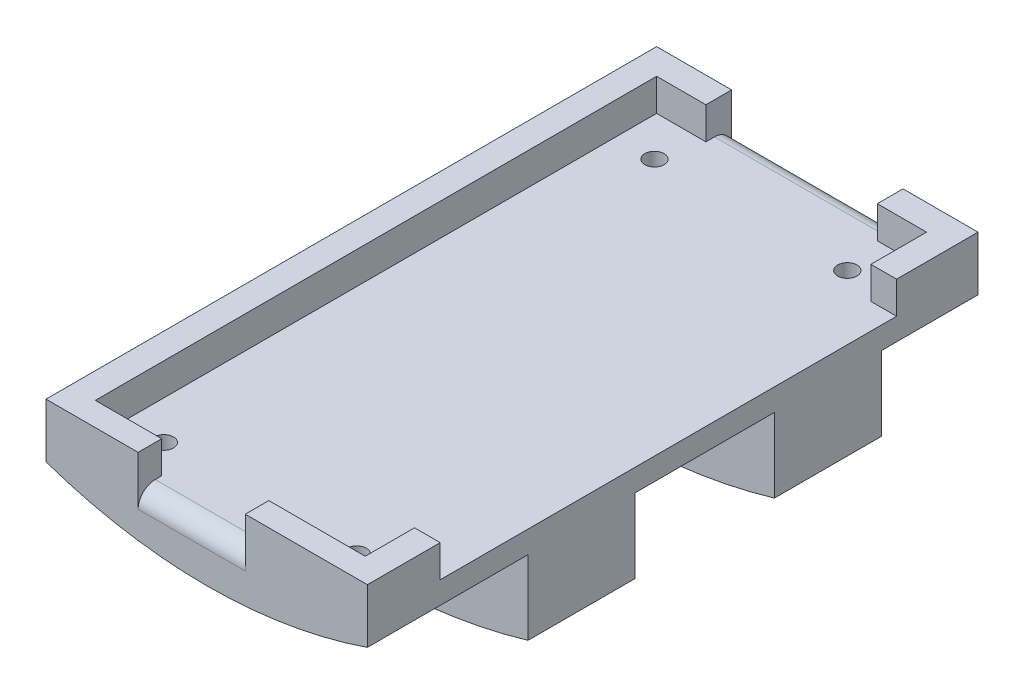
from build123d import *

# Parameters (mm, degrees)
SKETCH1_R               = 58.42
BOSS_EXTRUDE1_DEPTH     = 72.39
BOSS_EXTRUDE2_START     = -40.64
SKETCH3_R               = 66.802
BOSS_EXTRUDE2_DEPTH     = 12.7
BOSS_EXTRUDE3_START     = -11.43
SKETCH5_R               = 66.802
BOSS_EXTRUDE3_DEPTH     = 12.7
SKETCH2_W               = 50.8
SKETCH2_H               = 152.4
CUT_EXTRUDE1_DEPTH      = 160.321588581
SKETCH7_W               = 38.1
SKETCH7_H               = 114.3
CUT_EXTRUDE3_DEPTH      = 146.889560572
CUT_EXTRUDE4_START      = -3.048
SKETCH8_W               = 32.004
SKETCH8_H               = 3.81
CUT_EXTRUDE4_DEPTH      = 66.548
SKETCH9_W               = 20.32
SKETCH9_H               = 3.81
CUT_EXTRUDE5_DEPTH      = 5.08
FILLET1_R               = 2.032
SKETCH10_W              = 54.102
SKETCH10_H              = 3.81
CUT_EXTRUDE6_DEPTH      = 82.004488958
SKETCH11_W              = 12.7
SKETCH11_H              = 3.81
CUT_EXTRUDE7_DEPTH      = 73.796140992
FILLET2_R               = 2.032
SKETCH12_R              = 1.143
CUT_EXTRUDE8_DEPTH      = 77.190313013
CUT_EXTRUDE9_REACH      = 80.476
CUT_EXTRUDE9_END_RADIUS = 58.42
CUT_EXTRUDE9_START      = -2.286


with BuildPart() as part:
    # Sketch1 → Boss-Extrude1 (new body)
    with BuildSketch(Plane.XY):
        with Locations((0, 58.42)):
            Circle(SKETCH1_R)
    extrude(amount=BOSS_EXTRUDE1_DEPTH)

    # Sketch3 → Boss-Extrude2 (add)
    with BuildSketch(Plane(origin=(0, 0, 0), x_dir=(-1, 0, 0), z_dir=(0, 0, -1)).offset(BOSS_EXTRUDE2_START)):
        with Locations((0, 58.42)):
            Circle(SKETCH3_R)
    extrude(amount=-BOSS_EXTRUDE2_DEPTH)

    # Sketch5 → Boss-Extrude3 (add)
    with BuildSketch(Plane(origin=(0, 0, 0), x_dir=(-1, 0, 0), z_dir=(0, 0, -1)).offset(BOSS_EXTRUDE3_START)):
        with Locations((0, 58.42)):
            Circle(SKETCH5_R)
    extrude(amount=-BOSS_EXTRUDE3_DEPTH)

    # Sketch2 → Cut-Extrude1 (cut, through all)
    with BuildSketch(Plane(origin=(0, 0, 0), x_dir=(-1, 0, 0), z_dir=(0, 0, -1))):
        with Locations((44.45, 50.8)):
            Rectangle(SKETCH2_W, SKETCH2_H)
        with Locations((-44.45, 50.8)):
            Rectangle(SKETCH2_W, SKETCH2_H)
    extrude(amount=-CUT_EXTRUDE1_DEPTH, mode=Mode.SUBTRACT)

    # Sketch7 → Cut-Extrude3 (cut, through all)
    with BuildSketch(Plane(origin=(0, 0, 0), x_dir=(-1, 0, 0), z_dir=(0, 0, -1))):
        with Locations((0, 66.781844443)):
            Rectangle(SKETCH7_W, SKETCH7_H)
    extrude(amount=-CUT_EXTRUDE3_DEPTH, mode=Mode.SUBTRACT)


with BuildPart() as cut_extrude3_kept_piece:
    # of the separate pieces the step leaves, the one the design keeps (cut_extrude3_pieces_kept)
    add(part.part.solids().sort_by_distance((-19.05, 3.193250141, 0))[0])

    # Sketch8 → Cut-Extrude4 (cut)
    with BuildSketch(Plane(origin=(0, 0, 0), x_dir=(-1, 0, 0), z_dir=(0, 0, -1)).offset(CUT_EXTRUDE4_START)):
        with Locations((0, 7.726844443)):
            Rectangle(SKETCH8_W, SKETCH8_H)
    extrude(amount=-CUT_EXTRUDE4_DEPTH, mode=Mode.SUBTRACT)

    # Sketch9 → Cut-Extrude5 (cut)
    with BuildSketch(Plane(origin=(0, 0, 0), x_dir=(-1, 0, 0), z_dir=(0, 0, -1))):
        with Locations((0, 7.726844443)):
            Rectangle(SKETCH9_W, SKETCH9_H)
    extrude(amount=-CUT_EXTRUDE5_DEPTH, mode=Mode.SUBTRACT)

    # Fillet1
    fillet1_edges = [cut_extrude3_kept_piece.edges().sort_by_distance(p)[0] for p in [
        (0, 5.821844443, 0),
    ]]
    fillet(fillet1_edges, radius=FILLET1_R)

    # Sketch10 → Cut-Extrude6 (cut, through all)
    with BuildSketch(Plane.ZY.offset(-16.002)):
        with Locations((36.703, 7.726844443)):
            Rectangle(SKETCH10_W, SKETCH10_H)
    extrude(amount=-CUT_EXTRUDE6_DEPTH, mode=Mode.SUBTRACT)

    # Sketch11 → Cut-Extrude7 (cut, through all)
    with BuildSketch(Plane(origin=(0, 0, 69.596), x_dir=(-1, 0, 0), z_dir=(0, 0, -1))):
        with Locations((1.778, 7.726844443)):
            Rectangle(SKETCH11_W, SKETCH11_H)
    extrude(amount=-CUT_EXTRUDE7_DEPTH, mode=Mode.SUBTRACT)

    # Fillet2
    fillet2_edges = [cut_extrude3_kept_piece.edges().sort_by_distance(p)[0] for p in [
        (-1.778, 5.821844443, 72.39),
    ]]
    fillet(fillet2_edges, radius=FILLET2_R)

    # Sketch12 → Cut-Extrude8 (cut, through all)
    with BuildSketch(Plane(origin=(0, 5.821844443, 0), x_dir=(1, 0, 0), z_dir=(0, 1, 0))):
        with Locations(Location((11.43, -66.04, 0), (0, 0, 180))):
            Circle(SKETCH12_R)
        with Locations(Location((-11.43, -66.04, 0), (0, 0, 180))):
            Circle(SKETCH12_R)
        with Locations(Location((11.43, -7.874, 0), (0, 0, 180))):
            Circle(SKETCH12_R)
        with Locations(Location((-11.43, -7.874, 0), (0, 0, 180))):
            Circle(SKETCH12_R)
    extrude(amount=-CUT_EXTRUDE8_DEPTH, mode=Mode.SUBTRACT)

    # Cut-Extrude9: up to this cylinder (the profile starts inside it)
    cut_extrude9_end = Plane(origin=(0, 58.42, 36.957), z_dir=(0, 0, -1)) * Cylinder(CUT_EXTRUDE9_END_RADIUS, 336.958, mode=Mode.PRIVATE)
    # Sketch13 → Cut-Extrude9 (cut, up to the surface)
    with BuildSketch(Plane(origin=(0, 5.821844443, 0), x_dir=(1, 0, 0), z_dir=(0, 1, 0)).offset(CUT_EXTRUDE9_START), mode=Mode.PRIVATE) as cut_extrude9_sk1:
        Polygon((13.776351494, -7.874), (12.603175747, -5.842), (10.256824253, -5.842), (9.083648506, -7.874), (10.256824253, -9.906), (12.603175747, -9.906), align=None)
    cut_extrude9_tool1 = extrude(cut_extrude9_sk1.sketch, amount=-CUT_EXTRUDE9_REACH, mode=Mode.PRIVATE) & cut_extrude9_end
    add(cut_extrude9_tool1.solids().sort_by_distance((11.43, 3.535844, 7.874))[0], mode=Mode.SUBTRACT)
    # Sketch13 → Cut-Extrude9 (cut, up to the surface)
    with BuildSketch(Plane(origin=(0, 5.821844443, 0), x_dir=(1, 0, 0), z_dir=(0, 1, 0)).offset(CUT_EXTRUDE9_START), mode=Mode.PRIVATE) as cut_extrude9_sk2:
        Polygon((-9.083648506, -7.874), (-10.256824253, -5.842), (-12.603175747, -5.842), (-13.776351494, -7.874), (-12.603175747, -9.906), (-10.256824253, -9.906), align=None)
    cut_extrude9_tool2 = extrude(cut_extrude9_sk2.sketch, amount=-CUT_EXTRUDE9_REACH, mode=Mode.PRIVATE) & cut_extrude9_end
    add(cut_extrude9_tool2.solids().sort_by_distance((-11.43, 3.535844, 7.874))[0], mode=Mode.SUBTRACT)
    # Sketch13 → Cut-Extrude9 (cut, up to the surface)
    with BuildSketch(Plane(origin=(0, 5.821844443, 0), x_dir=(1, 0, 0), z_dir=(0, 1, 0)).offset(CUT_EXTRUDE9_START), mode=Mode.PRIVATE) as cut_extrude9_sk3:
        Polygon((-9.083648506, -66.04), (-10.256824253, -64.008), (-12.603175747, -64.008), (-13.776351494, -66.04), (-12.603175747, -68.072), (-10.256824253, -68.072), align=None)
    cut_extrude9_tool3 = extrude(cut_extrude9_sk3.sketch, amount=-CUT_EXTRUDE9_REACH, mode=Mode.PRIVATE) & cut_extrude9_end
    add(cut_extrude9_tool3.solids().sort_by_distance((-11.43, 3.535844, 66.04))[0], mode=Mode.SUBTRACT)
    # Sketch13 → Cut-Extrude9 (cut, up to the surface)
    with BuildSketch(Plane(origin=(0, 5.821844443, 0), x_dir=(1, 0, 0), z_dir=(0, 1, 0)).offset(CUT_EXTRUDE9_START), mode=Mode.PRIVATE) as cut_extrude9_sk4:
        Polygon((13.776351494, -66.04), (12.603175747, -64.008), (10.256824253, -64.008), (9.083648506, -66.04), (10.256824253, -68.072), (12.603175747, -68.072), align=None)
    cut_extrude9_tool4 = extrude(cut_extrude9_sk4.sketch, amount=-CUT_EXTRUDE9_REACH, mode=Mode.PRIVATE) & cut_extrude9_end
    add(cut_extrude9_tool4.solids().sort_by_distance((11.43, 3.535844, 66.04))[0], mode=Mode.SUBTRACT)


solid = cut_extrude3_kept_piece.part
